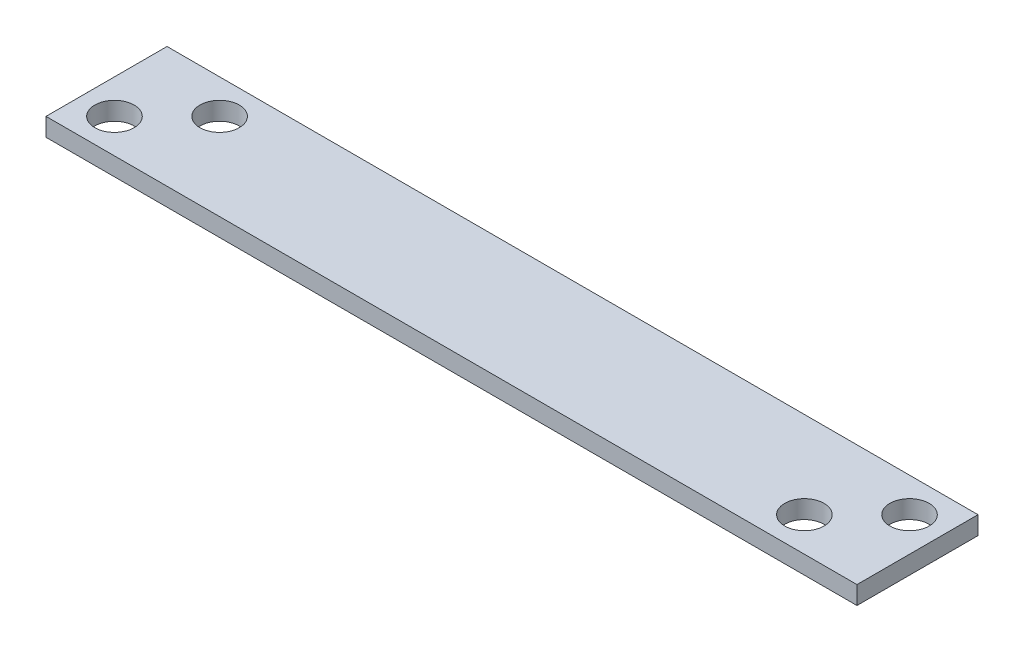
from build123d import *

# Parameters (mm, degrees)
SKETCH1_W      = 134
SKETCH1_H      = 20
SKETCH1_R      = 3.25
EXTRUDE1_DEPTH = 3


with BuildPart() as part:
    # Sketch1 → Extrude1 (new body)
    with BuildSketch(Plane(origin=(0, 0, 0), x_dir=(1, 0, 0), z_dir=(0, 1, 0))):
        with Locations((67, 10)):
            Rectangle(SKETCH1_W, SKETCH1_H)
        with Locations(Location((128.343145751, 14.343145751, 0), (0, 0, 270))):
            Circle(SKETCH1_R, mode=Mode.SUBTRACT)
        with Locations(Location((119.656854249, 5.656854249, 0), (0, 0, 270))):
            Circle(SKETCH1_R, mode=Mode.SUBTRACT)
        with Locations(Location((14.343145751, 14.343145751, 0), (0, 0, 270))):
            Circle(SKETCH1_R, mode=Mode.SUBTRACT)
        with Locations(Location((5.656854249, 5.656854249, 0), (0, 0, 270))):
            Circle(SKETCH1_R, mode=Mode.SUBTRACT)
    extrude(amount=EXTRUDE1_DEPTH)


solid = part.part
